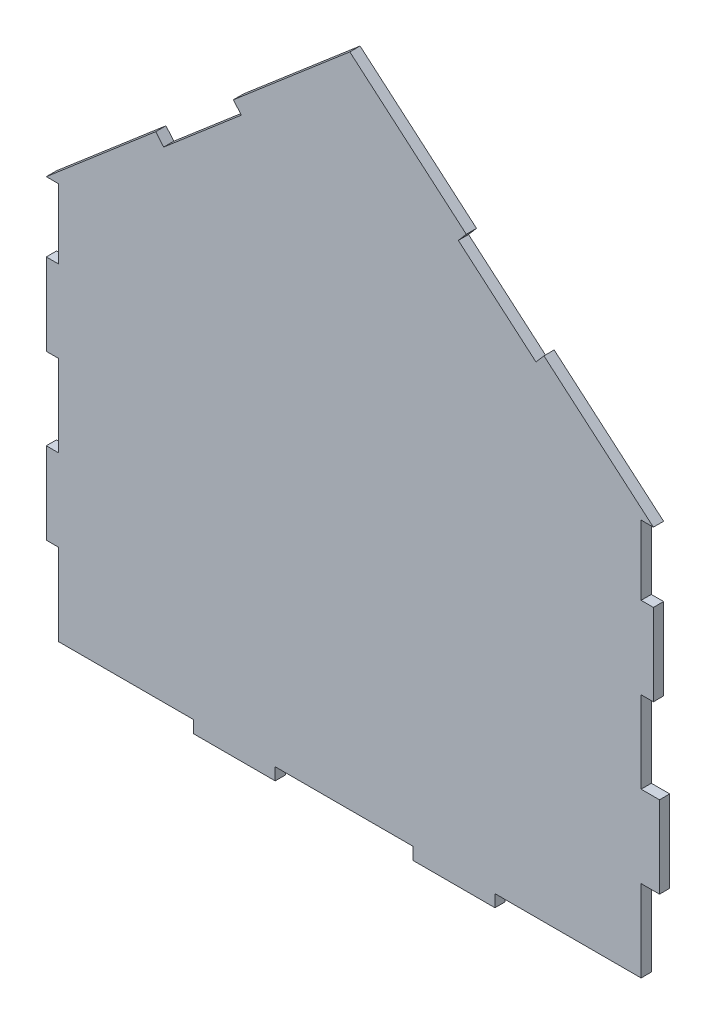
from build123d import *

# Parameters (mm, degrees)
SALIENTE_EXTRUIR1_DEPTH = 10


with BuildPart() as part:
    # Croquis1 → Saliente-Extruir1 (new body)
    with BuildSketch(Plane.XY):
        Polygon((285, -194), (142, -194), (142, -206), (62, -206), (62, -194), (-73, -194), (-73, -206), (-153, -206), (-153, -194), (-285, -194), (-285, -114), (-297, -114), (-297, -34), (-285, -34), (-285, 46), (-297, 46), (-297, 126), (-285, 126), (-285, 194), (-297, 194), (-189.93036024, 285.641339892), (-182.127376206, 276.524682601), (-106.15523211, 341.549549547), (-113.958216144, 350.666206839), (0, 448.203507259), (113.958216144, 350.666206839), (106.15523211, 341.549549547), (182.127376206, 276.524682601), (189.93036024, 285.641339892), (297, 194), (285, 194), (285, 126), (297, 126), (297, 46), (285, 46), (285, -34), (303, -34), (303, -114), (285, -114), align=None)
    extrude(amount=SALIENTE_EXTRUIR1_DEPTH)


solid = part.part
